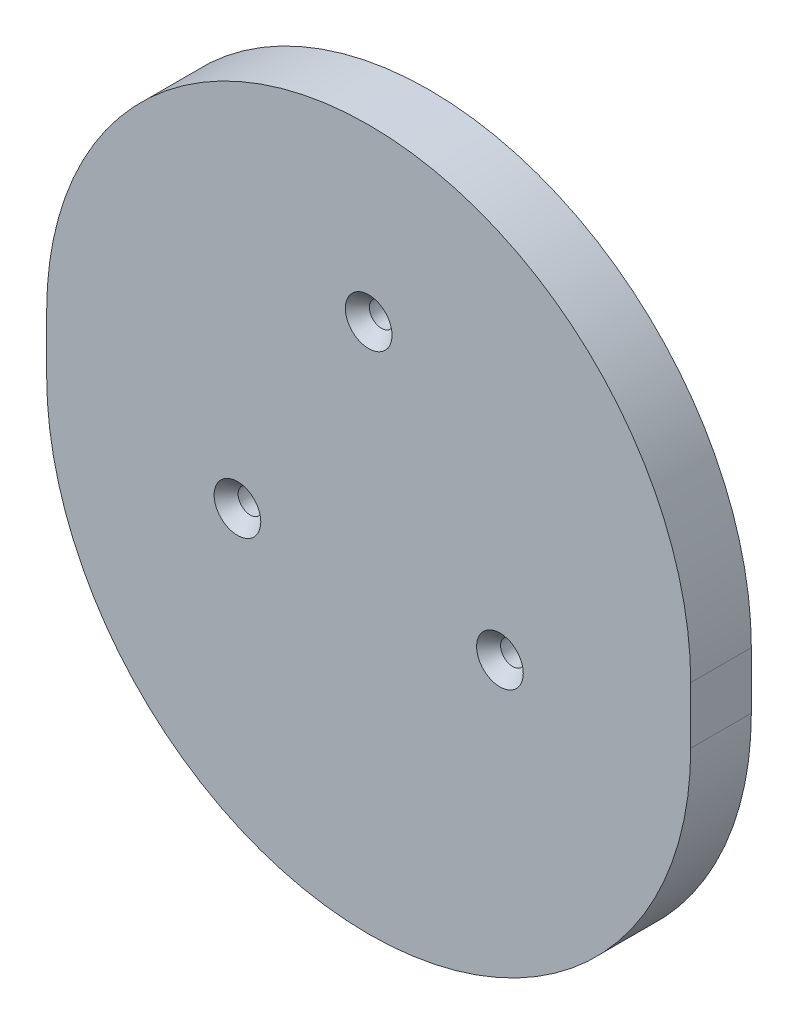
ISO-10303-21;
HEADER;
FILE_DESCRIPTION(('STEP AP214'),'2;1');
FILE_NAME('part.step','',(''),(''),'','','');
FILE_SCHEMA(('AUTOMOTIVE_DESIGN { 1 0 10303 214 1 1 1 1 }'));
ENDSEC;
DATA;
#1=APPLICATION_CONTEXT('core data for automotive mechanical design processes');
#2=APPLICATION_PROTOCOL_DEFINITION('international standard','automotive_design',2000,#1);
#3=PRODUCT_CONTEXT('',#1,'mechanical');
#4=PRODUCT('Part','Part','',(#3));
#5=PRODUCT_RELATED_PRODUCT_CATEGORY('part','',(#4));
#6=PRODUCT_DEFINITION_FORMATION('','',#4);
#7=PRODUCT_DEFINITION_CONTEXT('part definition',#1,'design');
#8=PRODUCT_DEFINITION('design','',#6,#7);
#9=PRODUCT_DEFINITION_SHAPE('','',#8);
#10=(LENGTH_UNIT() NAMED_UNIT(*) SI_UNIT(.MILLI.,.METRE.));
#11=(NAMED_UNIT(*) PLANE_ANGLE_UNIT() SI_UNIT($,.RADIAN.));
#12=(NAMED_UNIT(*) SI_UNIT($,.STERADIAN.) SOLID_ANGLE_UNIT());
#13=UNCERTAINTY_MEASURE_WITH_UNIT(LENGTH_MEASURE(1.E-05),#10,'distance_accuracy_value','');
#14=(GEOMETRIC_REPRESENTATION_CONTEXT(3) GLOBAL_UNCERTAINTY_ASSIGNED_CONTEXT((#13)) GLOBAL_UNIT_ASSIGNED_CONTEXT((#10,
#11,#12)) REPRESENTATION_CONTEXT('',''));
#15=CARTESIAN_POINT('',(0.,0.,0.));
#16=DIRECTION('',(0.,0.,1.));
#17=DIRECTION('',(1.,0.,0.));
#18=AXIS2_PLACEMENT_3D('',#15,#16,#17);
#19=CARTESIAN_POINT('',(0.,0.,-12.7));
#20=DIRECTION('',(0.,0.,1.));
#21=DIRECTION('',(1.,0.,0.));
#22=AXIS2_PLACEMENT_3D('',#19,#20,#21);
#23=PLANE('',#22);
#24=CARTESIAN_POINT('',(-27.4963065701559,-15.8750000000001,-12.7));
#25=DIRECTION('',(0.,0.,1.));
#26=DIRECTION('',(1.,0.,0.));
#27=AXIS2_PLACEMENT_3D('',#24,#25,#26);
#28=CIRCLE('',#27,2.55269999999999);
#29=CARTESIAN_POINT('',(-24.9436065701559,-15.8750000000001,-12.7));
#30=VERTEX_POINT('',#29);
#31=EDGE_CURVE('E12',#30,#30,#28,.T.);
#32=ORIENTED_EDGE('',*,*,#31,.T.);
#33=EDGE_LOOP('',(#32));
#34=FACE_BOUND('',#33,.T.);
#35=CARTESIAN_POINT('',(27.4963065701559,-15.8750000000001,-12.7));
#36=DIRECTION('',(0.,0.,1.));
#37=DIRECTION('',(1.,0.,0.));
#38=AXIS2_PLACEMENT_3D('',#35,#36,#37);
#39=CIRCLE('',#38,2.55269999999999);
#40=CARTESIAN_POINT('',(30.0490065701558,-15.8750000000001,-12.7));
#41=VERTEX_POINT('',#40);
#42=EDGE_CURVE('E134',#41,#41,#39,.T.);
#43=ORIENTED_EDGE('',*,*,#42,.T.);
#44=EDGE_LOOP('',(#43));
#45=FACE_BOUND('',#44,.T.);
#46=CARTESIAN_POINT('',(0.,31.75,-12.7));
#47=DIRECTION('',(0.,0.,1.));
#48=DIRECTION('',(1.,0.,0.));
#49=AXIS2_PLACEMENT_3D('',#46,#47,#48);
#50=CIRCLE('',#49,2.5527);
#51=CARTESIAN_POINT('',(2.5527,31.75,-12.7));
#52=VERTEX_POINT('',#51);
#53=EDGE_CURVE('E124',#52,#52,#50,.T.);
#54=ORIENTED_EDGE('',*,*,#53,.T.);
#55=EDGE_LOOP('',(#54));
#56=FACE_BOUND('',#55,.T.);
#57=CARTESIAN_POINT('',(0.,0.,-12.7));
#58=DIRECTION('',(0.,0.,1.));
#59=DIRECTION('',(1.,0.,0.));
#60=AXIS2_PLACEMENT_3D('',#57,#58,#59);
#61=CIRCLE('',#60,67.46875);
#62=CARTESIAN_POINT('',(67.46875,0.,-12.7));
#63=VERTEX_POINT('',#62);
#64=CARTESIAN_POINT('',(-67.46875,0.,-12.7));
#65=VERTEX_POINT('',#64);
#66=EDGE_CURVE('E56',#63,#65,#61,.T.);
#67=ORIENTED_EDGE('',*,*,#66,.F.);
#68=DIRECTION('',(0.,1.,0.));
#69=VECTOR('',#68,1.);
#70=CARTESIAN_POINT('',(67.46875,0.,-12.7));
#71=LINE('',#70,#69);
#72=CARTESIAN_POINT('',(67.46875,-11.90625,-12.7));
#73=VERTEX_POINT('',#72);
#74=EDGE_CURVE('E86',#73,#63,#71,.T.);
#75=ORIENTED_EDGE('',*,*,#74,.F.);
#76=CARTESIAN_POINT('',(0.,-11.90625,-12.7));
#77=DIRECTION('',(0.,0.,1.));
#78=DIRECTION('',(-1.,0.,0.));
#79=AXIS2_PLACEMENT_3D('',#76,#77,#78);
#80=CIRCLE('',#79,67.46875);
#81=CARTESIAN_POINT('',(-67.46875,-11.90625,-12.7));
#82=VERTEX_POINT('',#81);
#83=EDGE_CURVE('E93',#82,#73,#80,.T.);
#84=ORIENTED_EDGE('',*,*,#83,.F.);
#85=DIRECTION('',(0.,-1.,0.));
#86=VECTOR('',#85,1.);
#87=CARTESIAN_POINT('',(-67.46875,0.,-12.7));
#88=LINE('',#87,#86);
#89=EDGE_CURVE('E98',#65,#82,#88,.T.);
#90=ORIENTED_EDGE('',*,*,#89,.F.);
#91=EDGE_LOOP('',(#67,#75,#84,#90));
#92=FACE_BOUND('',#91,.T.);
#93=ADVANCED_FACE('F41',(#34,#45,#56,#92),#23,.F.);
#94=CARTESIAN_POINT('',(0.,0.,0.));
#95=DIRECTION('',(0.,0.,1.));
#96=DIRECTION('',(1.,0.,0.));
#97=AXIS2_PLACEMENT_3D('',#94,#95,#96);
#98=PLANE('',#97);
#99=CARTESIAN_POINT('',(-27.4963065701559,-15.8750000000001,0.));
#100=DIRECTION('',(0.,0.,1.));
#101=DIRECTION('',(1.,0.,0.));
#102=AXIS2_PLACEMENT_3D('',#99,#100,#101);
#103=CIRCLE('',#102,4.8895);
#104=CARTESIAN_POINT('',(-22.6068065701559,-15.8750000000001,0.));
#105=VERTEX_POINT('',#104);
#106=EDGE_CURVE('E138',#105,#105,#103,.T.);
#107=ORIENTED_EDGE('',*,*,#106,.F.);
#108=EDGE_LOOP('',(#107));
#109=FACE_BOUND('',#108,.T.);
#110=CARTESIAN_POINT('',(27.4963065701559,-15.8750000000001,0.));
#111=DIRECTION('',(0.,0.,1.));
#112=DIRECTION('',(1.,0.,0.));
#113=AXIS2_PLACEMENT_3D('',#110,#111,#112);
#114=CIRCLE('',#113,4.8895);
#115=CARTESIAN_POINT('',(32.3858065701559,-15.8750000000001,0.));
#116=VERTEX_POINT('',#115);
#117=EDGE_CURVE('E128',#116,#116,#114,.T.);
#118=ORIENTED_EDGE('',*,*,#117,.F.);
#119=EDGE_LOOP('',(#118));
#120=FACE_BOUND('',#119,.T.);
#121=CARTESIAN_POINT('',(0.,31.75,0.));
#122=DIRECTION('',(0.,0.,1.));
#123=DIRECTION('',(1.,0.,0.));
#124=AXIS2_PLACEMENT_3D('',#121,#122,#123);
#125=CIRCLE('',#124,4.8895);
#126=CARTESIAN_POINT('',(4.8895,31.75,0.));
#127=VERTEX_POINT('',#126);
#128=EDGE_CURVE('E114',#127,#127,#125,.T.);
#129=ORIENTED_EDGE('',*,*,#128,.F.);
#130=EDGE_LOOP('',(#129));
#131=FACE_BOUND('',#130,.T.);
#132=DIRECTION('',(0.,1.,0.));
#133=VECTOR('',#132,1.);
#134=CARTESIAN_POINT('',(67.46875,0.,0.));
#135=LINE('',#134,#133);
#136=CARTESIAN_POINT('',(67.46875,-11.90625,0.));
#137=VERTEX_POINT('',#136);
#138=CARTESIAN_POINT('',(67.46875,0.,0.));
#139=VERTEX_POINT('',#138);
#140=EDGE_CURVE('E88',#137,#139,#135,.T.);
#141=ORIENTED_EDGE('',*,*,#140,.T.);
#142=CARTESIAN_POINT('',(0.,0.,0.));
#143=DIRECTION('',(0.,0.,1.));
#144=DIRECTION('',(1.,0.,0.));
#145=AXIS2_PLACEMENT_3D('',#142,#143,#144);
#146=CIRCLE('',#145,67.46875);
#147=CARTESIAN_POINT('',(-67.46875,0.,0.));
#148=VERTEX_POINT('',#147);
#149=EDGE_CURVE('E105',#139,#148,#146,.T.);
#150=ORIENTED_EDGE('',*,*,#149,.T.);
#151=DIRECTION('',(0.,-1.,0.));
#152=VECTOR('',#151,1.);
#153=CARTESIAN_POINT('',(-67.46875,0.,0.));
#154=LINE('',#153,#152);
#155=CARTESIAN_POINT('',(-67.46875,-11.90625,0.));
#156=VERTEX_POINT('',#155);
#157=EDGE_CURVE('E109',#148,#156,#154,.T.);
#158=ORIENTED_EDGE('',*,*,#157,.T.);
#159=CARTESIAN_POINT('',(0.,-11.90625,0.));
#160=DIRECTION('',(0.,0.,1.));
#161=DIRECTION('',(-1.,0.,0.));
#162=AXIS2_PLACEMENT_3D('',#159,#160,#161);
#163=CIRCLE('',#162,67.46875);
#164=EDGE_CURVE('E64',#156,#137,#163,.T.);
#165=ORIENTED_EDGE('',*,*,#164,.T.);
#166=EDGE_LOOP('',(#141,#150,#158,#165));
#167=FACE_BOUND('',#166,.T.);
#168=ADVANCED_FACE('F43',(#109,#120,#131,#167),#98,.T.);
#169=CARTESIAN_POINT('',(-27.4963065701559,-15.8750000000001,0.));
#170=DIRECTION('',(0.,0.,1.));
#171=DIRECTION('',(1.,0.,0.));
#172=AXIS2_PLACEMENT_3D('',#169,#170,#171);
#173=CYLINDRICAL_SURFACE('',#172,2.5527);
#174=ORIENTED_EDGE('',*,*,#31,.F.);
#175=EDGE_LOOP('',(#174));
#176=FACE_BOUND('',#175,.T.);
#177=CARTESIAN_POINT('',(-27.4963065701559,-15.8750000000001,-2.68818089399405));
#178=DIRECTION('',(0.,0.,1.));
#179=DIRECTION('',(1.,0.,0.));
#180=AXIS2_PLACEMENT_3D('',#177,#178,#179);
#181=CIRCLE('',#180,2.5527);
#182=CARTESIAN_POINT('',(-24.9436065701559,-15.8750000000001,-2.68818089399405));
#183=VERTEX_POINT('',#182);
#184=EDGE_CURVE('E49',#183,#183,#181,.T.);
#185=ORIENTED_EDGE('',*,*,#184,.T.);
#186=EDGE_LOOP('',(#185));
#187=FACE_BOUND('',#186,.T.);
#188=ADVANCED_FACE('F143',(#176,#187),#173,.F.);
#189=CARTESIAN_POINT('',(-27.4963065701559,-15.8750000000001,0.));
#190=DIRECTION('',(0.,0.,1.));
#191=DIRECTION('',(1.,0.,0.));
#192=AXIS2_PLACEMENT_3D('',#189,#190,#191);
#193=CONICAL_SURFACE('',#192,4.8895,0.715584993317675);
#194=ORIENTED_EDGE('',*,*,#184,.F.);
#195=EDGE_LOOP('',(#194));
#196=FACE_BOUND('',#195,.T.);
#197=ORIENTED_EDGE('',*,*,#106,.T.);
#198=EDGE_LOOP('',(#197));
#199=FACE_BOUND('',#198,.T.);
#200=ADVANCED_FACE('F145',(#196,#199),#193,.F.);
#201=CARTESIAN_POINT('',(27.4963065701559,-15.8750000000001,0.));
#202=DIRECTION('',(0.,0.,1.));
#203=DIRECTION('',(1.,0.,0.));
#204=AXIS2_PLACEMENT_3D('',#201,#202,#203);
#205=CYLINDRICAL_SURFACE('',#204,2.5527);
#206=ORIENTED_EDGE('',*,*,#42,.F.);
#207=EDGE_LOOP('',(#206));
#208=FACE_BOUND('',#207,.T.);
#209=CARTESIAN_POINT('',(27.4963065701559,-15.8750000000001,-2.68818089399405));
#210=DIRECTION('',(0.,0.,1.));
#211=DIRECTION('',(1.,0.,0.));
#212=AXIS2_PLACEMENT_3D('',#209,#210,#211);
#213=CIRCLE('',#212,2.5527);
#214=CARTESIAN_POINT('',(30.0490065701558,-15.8750000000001,-2.68818089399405));
#215=VERTEX_POINT('',#214);
#216=EDGE_CURVE('E131',#215,#215,#213,.T.);
#217=ORIENTED_EDGE('',*,*,#216,.T.);
#218=EDGE_LOOP('',(#217));
#219=FACE_BOUND('',#218,.T.);
#220=ADVANCED_FACE('F148',(#208,#219),#205,.F.);
#221=CARTESIAN_POINT('',(27.4963065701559,-15.8750000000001,0.));
#222=DIRECTION('',(0.,0.,1.));
#223=DIRECTION('',(1.,0.,0.));
#224=AXIS2_PLACEMENT_3D('',#221,#222,#223);
#225=CONICAL_SURFACE('',#224,4.8895,0.715584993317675);
#226=ORIENTED_EDGE('',*,*,#216,.F.);
#227=EDGE_LOOP('',(#226));
#228=FACE_BOUND('',#227,.T.);
#229=ORIENTED_EDGE('',*,*,#117,.T.);
#230=EDGE_LOOP('',(#229));
#231=FACE_BOUND('',#230,.T.);
#232=ADVANCED_FACE('F188',(#228,#231),#225,.F.);
#233=CARTESIAN_POINT('',(0.,31.75,0.));
#234=DIRECTION('',(0.,0.,1.));
#235=DIRECTION('',(1.,0.,0.));
#236=AXIS2_PLACEMENT_3D('',#233,#234,#235);
#237=CYLINDRICAL_SURFACE('',#236,2.5527);
#238=ORIENTED_EDGE('',*,*,#53,.F.);
#239=EDGE_LOOP('',(#238));
#240=FACE_BOUND('',#239,.T.);
#241=CARTESIAN_POINT('',(0.,31.75,-2.68818089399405));
#242=DIRECTION('',(0.,0.,1.));
#243=DIRECTION('',(1.,0.,0.));
#244=AXIS2_PLACEMENT_3D('',#241,#242,#243);
#245=CIRCLE('',#244,2.5527);
#246=CARTESIAN_POINT('',(2.5527,31.75,-2.68818089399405));
#247=VERTEX_POINT('',#246);
#248=EDGE_CURVE('E120',#247,#247,#245,.T.);
#249=ORIENTED_EDGE('',*,*,#248,.T.);
#250=EDGE_LOOP('',(#249));
#251=FACE_BOUND('',#250,.T.);
#252=ADVANCED_FACE('F173',(#240,#251),#237,.F.);
#253=CARTESIAN_POINT('',(0.,31.75,0.));
#254=DIRECTION('',(0.,0.,1.));
#255=DIRECTION('',(1.,0.,0.));
#256=AXIS2_PLACEMENT_3D('',#253,#254,#255);
#257=CONICAL_SURFACE('',#256,4.8895,0.715584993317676);
#258=ORIENTED_EDGE('',*,*,#248,.F.);
#259=EDGE_LOOP('',(#258));
#260=FACE_BOUND('',#259,.T.);
#261=ORIENTED_EDGE('',*,*,#128,.T.);
#262=EDGE_LOOP('',(#261));
#263=FACE_BOUND('',#262,.T.);
#264=ADVANCED_FACE('F166',(#260,#263),#257,.F.);
#265=CARTESIAN_POINT('',(0.,0.,-12.7));
#266=DIRECTION('',(0.,0.,1.));
#267=DIRECTION('',(1.,0.,0.));
#268=AXIS2_PLACEMENT_3D('',#265,#266,#267);
#269=CYLINDRICAL_SURFACE('',#268,67.46875);
#270=ORIENTED_EDGE('',*,*,#149,.F.);
#271=DIRECTION('',(0.,0.,1.));
#272=VECTOR('',#271,1.);
#273=CARTESIAN_POINT('',(67.46875,0.,-12.7));
#274=LINE('',#273,#272);
#275=EDGE_CURVE('E89',#63,#139,#274,.T.);
#276=ORIENTED_EDGE('',*,*,#275,.F.);
#277=ORIENTED_EDGE('',*,*,#66,.T.);
#278=DIRECTION('',(0.,0.,1.));
#279=VECTOR('',#278,1.);
#280=CARTESIAN_POINT('',(-67.46875,0.,-12.7));
#281=LINE('',#280,#279);
#282=EDGE_CURVE('E100',#65,#148,#281,.T.);
#283=ORIENTED_EDGE('',*,*,#282,.T.);
#284=EDGE_LOOP('',(#270,#276,#277,#283));
#285=FACE_BOUND('',#284,.T.);
#286=ADVANCED_FACE('F164',(#285),#269,.T.);
#287=CARTESIAN_POINT('',(67.46875,0.,-12.7));
#288=DIRECTION('',(1.,0.,0.));
#289=DIRECTION('',(0.,1.,0.));
#290=AXIS2_PLACEMENT_3D('',#287,#288,#289);
#291=PLANE('',#290);
#292=ORIENTED_EDGE('',*,*,#140,.F.);
#293=DIRECTION('',(0.,0.,1.));
#294=VECTOR('',#293,1.);
#295=CARTESIAN_POINT('',(67.46875,-11.90625,-12.7));
#296=LINE('',#295,#294);
#297=EDGE_CURVE('E82',#73,#137,#296,.T.);
#298=ORIENTED_EDGE('',*,*,#297,.F.);
#299=ORIENTED_EDGE('',*,*,#74,.T.);
#300=ORIENTED_EDGE('',*,*,#275,.T.);
#301=EDGE_LOOP('',(#292,#298,#299,#300));
#302=FACE_BOUND('',#301,.T.);
#303=ADVANCED_FACE('F84',(#302),#291,.T.);
#304=CARTESIAN_POINT('',(0.,-11.90625,-12.7));
#305=DIRECTION('',(0.,0.,1.));
#306=DIRECTION('',(1.,0.,0.));
#307=AXIS2_PLACEMENT_3D('',#304,#305,#306);
#308=CYLINDRICAL_SURFACE('',#307,67.46875);
#309=ORIENTED_EDGE('',*,*,#164,.F.);
#310=DIRECTION('',(0.,0.,1.));
#311=VECTOR('',#310,1.);
#312=CARTESIAN_POINT('',(-67.46875,-11.90625,-12.7));
#313=LINE('',#312,#311);
#314=EDGE_CURVE('E90',#82,#156,#313,.T.);
#315=ORIENTED_EDGE('',*,*,#314,.F.);
#316=ORIENTED_EDGE('',*,*,#83,.T.);
#317=ORIENTED_EDGE('',*,*,#297,.T.);
#318=EDGE_LOOP('',(#309,#315,#316,#317));
#319=FACE_BOUND('',#318,.T.);
#320=ADVANCED_FACE('F94',(#319),#308,.T.);
#321=CARTESIAN_POINT('',(-67.46875,0.,-12.7));
#322=DIRECTION('',(-1.,0.,0.));
#323=DIRECTION('',(0.,-1.,0.));
#324=AXIS2_PLACEMENT_3D('',#321,#322,#323);
#325=PLANE('',#324);
#326=ORIENTED_EDGE('',*,*,#157,.F.);
#327=ORIENTED_EDGE('',*,*,#282,.F.);
#328=ORIENTED_EDGE('',*,*,#89,.T.);
#329=ORIENTED_EDGE('',*,*,#314,.T.);
#330=EDGE_LOOP('',(#326,#327,#328,#329));
#331=FACE_BOUND('',#330,.T.);
#332=ADVANCED_FACE('F161',(#331),#325,.T.);
#333=CLOSED_SHELL('',(#93,#168,#188,#200,#220,#232,#252,#264,#286,#303,#320,#332));
#334=MANIFOLD_SOLID_BREP('B2',#333);
#335=ADVANCED_BREP_SHAPE_REPRESENTATION('',(#18,#334),#14);
#336=SHAPE_DEFINITION_REPRESENTATION(#9,#335);
ENDSEC;
END-ISO-10303-21;
